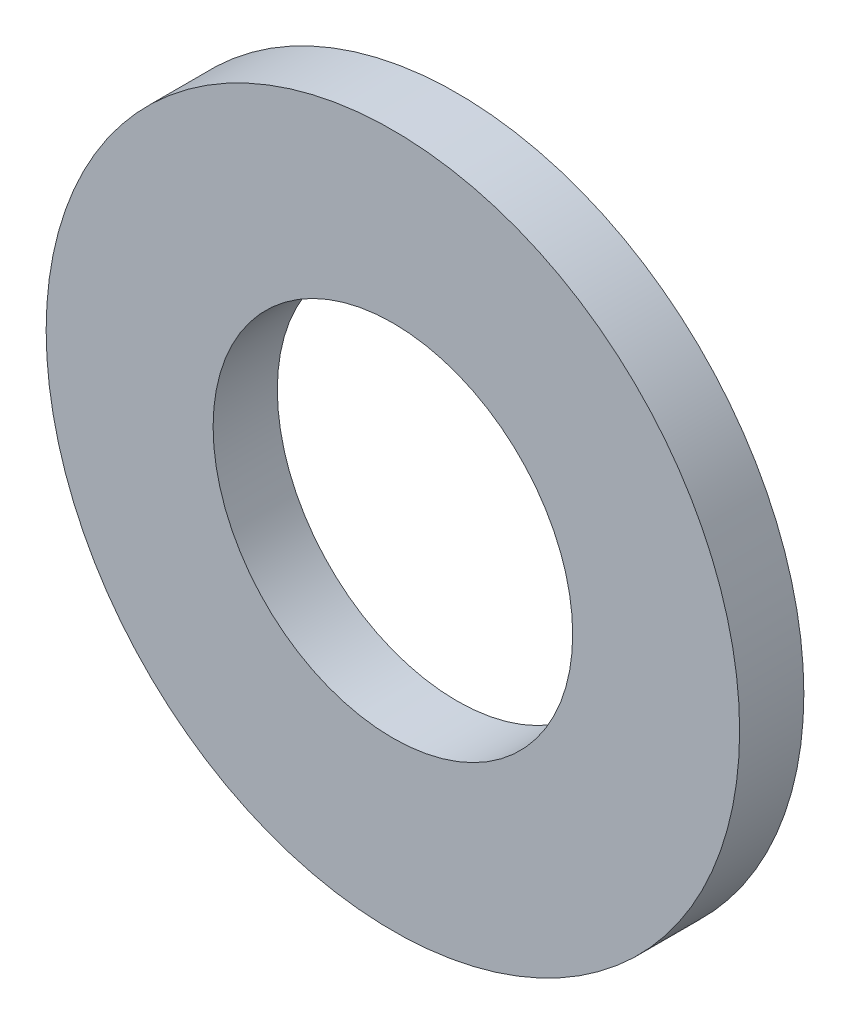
ISO-10303-21;
HEADER;
FILE_DESCRIPTION(('STEP AP214'),'2;1');
FILE_NAME('part.step','',(''),(''),'','','');
FILE_SCHEMA(('AUTOMOTIVE_DESIGN { 1 0 10303 214 1 1 1 1 }'));
ENDSEC;
DATA;
#1=APPLICATION_CONTEXT('core data for automotive mechanical design processes');
#2=APPLICATION_PROTOCOL_DEFINITION('international standard','automotive_design',2000,#1);
#3=PRODUCT_CONTEXT('',#1,'mechanical');
#4=PRODUCT('Part','Part','',(#3));
#5=PRODUCT_RELATED_PRODUCT_CATEGORY('part','',(#4));
#6=PRODUCT_DEFINITION_FORMATION('','',#4);
#7=PRODUCT_DEFINITION_CONTEXT('part definition',#1,'design');
#8=PRODUCT_DEFINITION('design','',#6,#7);
#9=PRODUCT_DEFINITION_SHAPE('','',#8);
#10=(LENGTH_UNIT() NAMED_UNIT(*) SI_UNIT(.MILLI.,.METRE.));
#11=(NAMED_UNIT(*) PLANE_ANGLE_UNIT() SI_UNIT($,.RADIAN.));
#12=(NAMED_UNIT(*) SI_UNIT($,.STERADIAN.) SOLID_ANGLE_UNIT());
#13=UNCERTAINTY_MEASURE_WITH_UNIT(LENGTH_MEASURE(1.E-05),#10,'distance_accuracy_value','');
#14=(GEOMETRIC_REPRESENTATION_CONTEXT(3) GLOBAL_UNCERTAINTY_ASSIGNED_CONTEXT((#13)) GLOBAL_UNIT_ASSIGNED_CONTEXT((#10,
#11,#12)) REPRESENTATION_CONTEXT('',''));
#15=CARTESIAN_POINT('',(0.,0.,0.));
#16=DIRECTION('',(0.,0.,1.));
#17=DIRECTION('',(1.,0.,0.));
#18=AXIS2_PLACEMENT_3D('',#15,#16,#17);
#19=CARTESIAN_POINT('',(0.,0.,2.5));
#20=DIRECTION('',(0.,0.,1.));
#21=DIRECTION('',(1.,0.,0.));
#22=AXIS2_PLACEMENT_3D('',#19,#20,#21);
#23=PLANE('',#22);
#24=CARTESIAN_POINT('',(0.,0.,2.5));
#25=DIRECTION('',(0.,0.,1.));
#26=DIRECTION('',(1.,0.,0.));
#27=AXIS2_PLACEMENT_3D('',#24,#25,#26);
#28=CIRCLE('',#27,13.5);
#29=CARTESIAN_POINT('',(13.5,0.,2.5));
#30=VERTEX_POINT('',#29);
#31=EDGE_CURVE('E10',#30,#30,#28,.T.);
#32=ORIENTED_EDGE('',*,*,#31,.T.);
#33=EDGE_LOOP('',(#32));
#34=FACE_BOUND('',#33,.T.);
#35=CARTESIAN_POINT('',(0.,0.,2.5));
#36=DIRECTION('',(0.,0.,1.));
#37=DIRECTION('',(1.,0.,0.));
#38=AXIS2_PLACEMENT_3D('',#35,#36,#37);
#39=CIRCLE('',#38,7.);
#40=CARTESIAN_POINT('',(7.,0.,2.5));
#41=VERTEX_POINT('',#40);
#42=EDGE_CURVE('E35',#41,#41,#39,.T.);
#43=ORIENTED_EDGE('',*,*,#42,.F.);
#44=EDGE_LOOP('',(#43));
#45=FACE_BOUND('',#44,.T.);
#46=ADVANCED_FACE('F24',(#34,#45),#23,.T.);
#47=CARTESIAN_POINT('',(0.,0.,0.));
#48=DIRECTION('',(0.,0.,1.));
#49=DIRECTION('',(1.,0.,0.));
#50=AXIS2_PLACEMENT_3D('',#47,#48,#49);
#51=PLANE('',#50);
#52=CARTESIAN_POINT('',(0.,0.,0.));
#53=DIRECTION('',(0.,0.,1.));
#54=DIRECTION('',(1.,0.,0.));
#55=AXIS2_PLACEMENT_3D('',#52,#53,#54);
#56=CIRCLE('',#55,13.5);
#57=CARTESIAN_POINT('',(13.5,0.,0.));
#58=VERTEX_POINT('',#57);
#59=EDGE_CURVE('E31',#58,#58,#56,.T.);
#60=ORIENTED_EDGE('',*,*,#59,.F.);
#61=EDGE_LOOP('',(#60));
#62=FACE_BOUND('',#61,.T.);
#63=CARTESIAN_POINT('',(0.,0.,0.));
#64=DIRECTION('',(0.,0.,1.));
#65=DIRECTION('',(1.,0.,0.));
#66=AXIS2_PLACEMENT_3D('',#63,#64,#65);
#67=CIRCLE('',#66,7.);
#68=CARTESIAN_POINT('',(7.,0.,0.));
#69=VERTEX_POINT('',#68);
#70=EDGE_CURVE('E39',#69,#69,#67,.T.);
#71=ORIENTED_EDGE('',*,*,#70,.T.);
#72=EDGE_LOOP('',(#71));
#73=FACE_BOUND('',#72,.T.);
#74=ADVANCED_FACE('F45',(#62,#73),#51,.F.);
#75=CARTESIAN_POINT('',(0.,0.,2.5));
#76=DIRECTION('',(0.,0.,-1.));
#77=DIRECTION('',(-1.,0.,0.));
#78=AXIS2_PLACEMENT_3D('',#75,#76,#77);
#79=CYLINDRICAL_SURFACE('',#78,13.5);
#80=ORIENTED_EDGE('',*,*,#31,.F.);
#81=EDGE_LOOP('',(#80));
#82=FACE_BOUND('',#81,.T.);
#83=ORIENTED_EDGE('',*,*,#59,.T.);
#84=EDGE_LOOP('',(#83));
#85=FACE_BOUND('',#84,.T.);
#86=ADVANCED_FACE('F26',(#82,#85),#79,.T.);
#87=CARTESIAN_POINT('',(0.,0.,2.5));
#88=DIRECTION('',(0.,0.,-1.));
#89=DIRECTION('',(-1.,0.,0.));
#90=AXIS2_PLACEMENT_3D('',#87,#88,#89);
#91=CYLINDRICAL_SURFACE('',#90,7.);
#92=ORIENTED_EDGE('',*,*,#42,.T.);
#93=EDGE_LOOP('',(#92));
#94=FACE_BOUND('',#93,.T.);
#95=ORIENTED_EDGE('',*,*,#70,.F.);
#96=EDGE_LOOP('',(#95));
#97=FACE_BOUND('',#96,.T.);
#98=ADVANCED_FACE('F47',(#94,#97),#91,.F.);
#99=CLOSED_SHELL('',(#46,#74,#86,#98));
#100=MANIFOLD_SOLID_BREP('B2',#99);
#101=ADVANCED_BREP_SHAPE_REPRESENTATION('',(#18,#100),#14);
#102=SHAPE_DEFINITION_REPRESENTATION(#9,#101);
ENDSEC;
END-ISO-10303-21;
